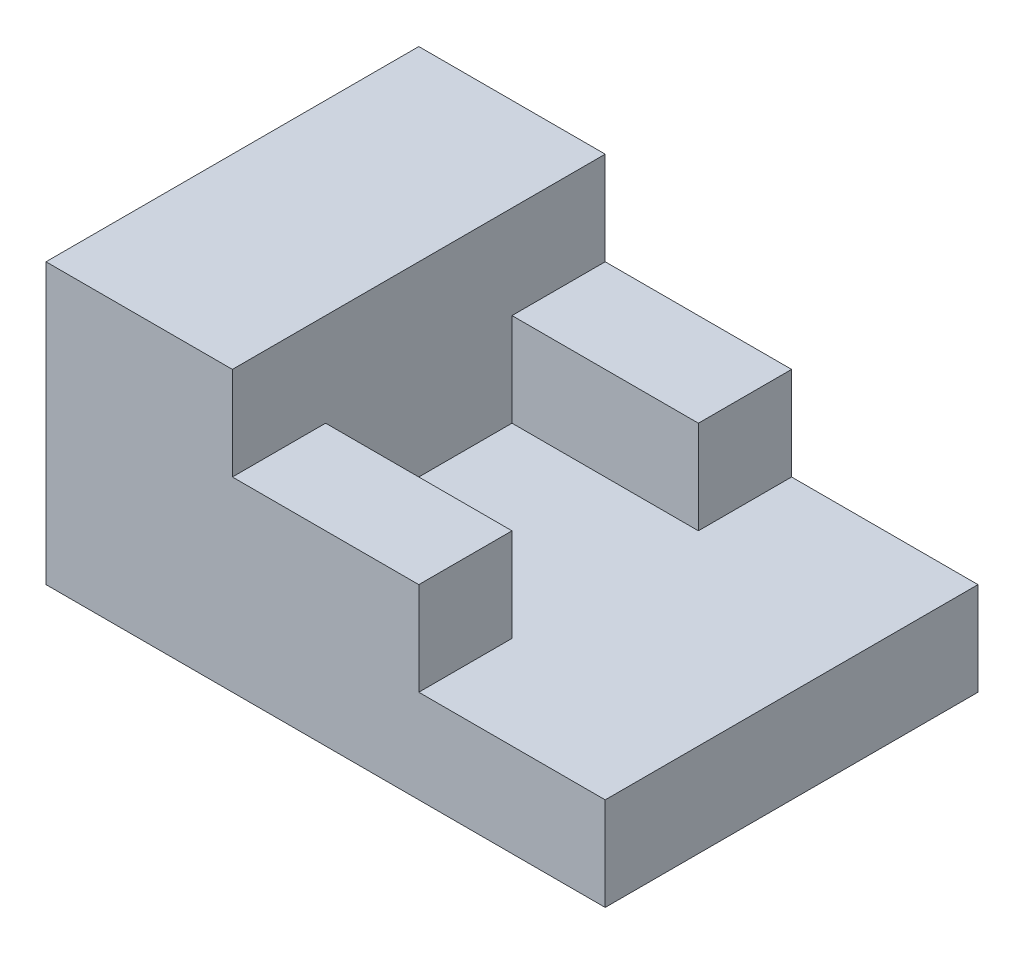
from build123d import *

# Parameters (mm, degrees)
EXTRUDE1_DEPTH = 10
SKETCH_W       = 20
SKETCH_H       = 10
EXTRUDE2_DEPTH = 20
EXTRUDE3_DEPTH = 30


with BuildPart() as part:
    # Sketch1 → Extrude1 (new body)
    with BuildSketch(Plane(origin=(0, 0, 0), x_dir=(1, 0, 0), z_dir=(0, 1, 0))):
        Polygon((40, 10), (20, 10), (20, 0), (60, 0), (60, 20), (40, 20), align=None)
        Polygon((60, 0), (20, 0), (20, -10), (40, -10), (40, -20), (60, -20), align=None)
    extrude(amount=EXTRUDE1_DEPTH)

    # Sketch → Extrude2 (add)
    with BuildSketch(Plane(origin=(0, 0, 0), x_dir=(1, 0, 0), z_dir=(0, 1, 0))):
        with Locations((30, -15)):
            Rectangle(SKETCH_W, SKETCH_H)
        with Locations((30, 15)):
            Rectangle(SKETCH_W, SKETCH_H)
    extrude(amount=EXTRUDE2_DEPTH)

    # Sketch 2 → Extrude3 (add)
    with BuildSketch(Plane(origin=(0, 0, 0), x_dir=(1, 0, 0), z_dir=(0, 1, 0))):
        Polygon((20, -10), (20, 0), (0, 0), (0, -20), (20, -20), align=None)
        Polygon((20, 10), (20, 20), (0, 20), (0, 0), (20, 0), align=None)
    extrude(amount=EXTRUDE3_DEPTH)


solid = part.part
